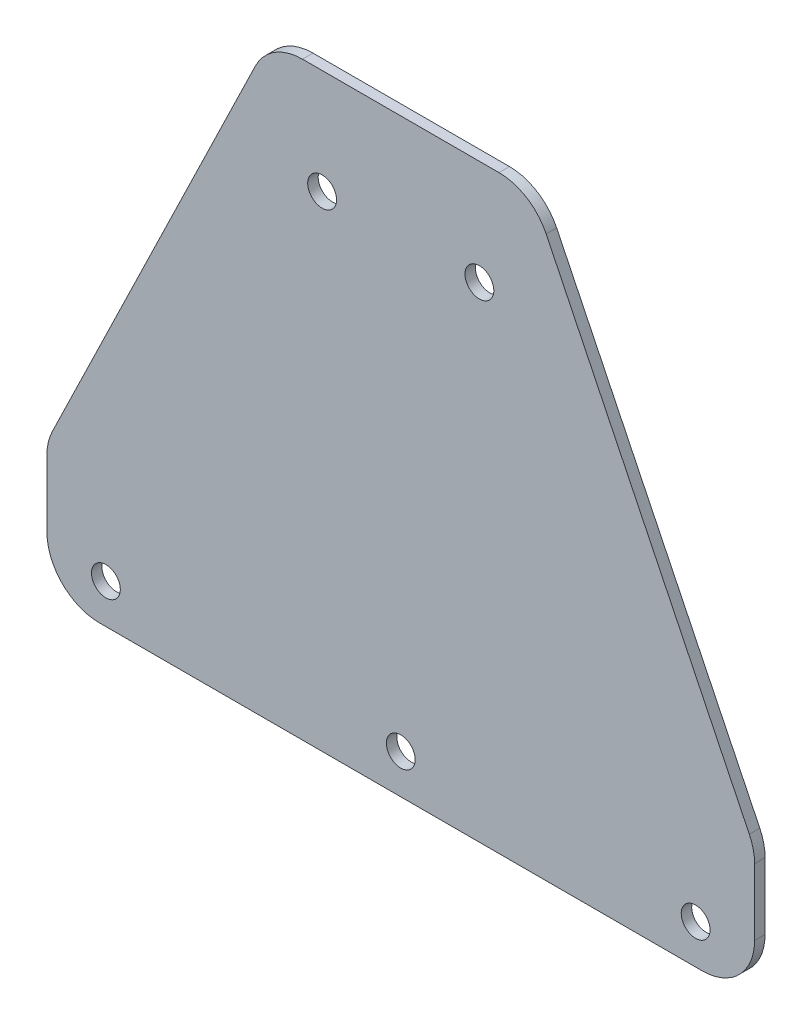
ISO-10303-21;
HEADER;
FILE_DESCRIPTION(('STEP AP214'),'2;1');
FILE_NAME('part.step','',(''),(''),'','','');
FILE_SCHEMA(('AUTOMOTIVE_DESIGN { 1 0 10303 214 1 1 1 1 }'));
ENDSEC;
DATA;
#1=APPLICATION_CONTEXT('core data for automotive mechanical design processes');
#2=APPLICATION_PROTOCOL_DEFINITION('international standard','automotive_design',2000,#1);
#3=PRODUCT_CONTEXT('',#1,'mechanical');
#4=PRODUCT('Part','Part','',(#3));
#5=PRODUCT_RELATED_PRODUCT_CATEGORY('part','',(#4));
#6=PRODUCT_DEFINITION_FORMATION('','',#4);
#7=PRODUCT_DEFINITION_CONTEXT('part definition',#1,'design');
#8=PRODUCT_DEFINITION('design','',#6,#7);
#9=PRODUCT_DEFINITION_SHAPE('','',#8);
#10=(LENGTH_UNIT() NAMED_UNIT(*) SI_UNIT(.MILLI.,.METRE.));
#11=(NAMED_UNIT(*) PLANE_ANGLE_UNIT() SI_UNIT($,.RADIAN.));
#12=(NAMED_UNIT(*) SI_UNIT($,.STERADIAN.) SOLID_ANGLE_UNIT());
#13=UNCERTAINTY_MEASURE_WITH_UNIT(LENGTH_MEASURE(1.E-05),#10,'distance_accuracy_value','');
#14=(GEOMETRIC_REPRESENTATION_CONTEXT(3) GLOBAL_UNCERTAINTY_ASSIGNED_CONTEXT((#13)) GLOBAL_UNIT_ASSIGNED_CONTEXT((#10,
#11,#12)) REPRESENTATION_CONTEXT('',''));
#15=CARTESIAN_POINT('',(0.,0.,0.));
#16=DIRECTION('',(0.,0.,1.));
#17=DIRECTION('',(1.,0.,0.));
#18=AXIS2_PLACEMENT_3D('',#15,#16,#17);
#19=CARTESIAN_POINT('',(135.,50.,4.));
#20=DIRECTION('',(-0.899508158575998,-0.436903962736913,0.));
#21=DIRECTION('',(0.436903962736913,-0.899508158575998,0.));
#22=AXIS2_PLACEMENT_3D('',#19,#20,#21);
#23=PLANE('',#22);
#24=DIRECTION('',(-0.436903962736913,0.899508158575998,0.));
#25=VECTOR('',#24,1.);
#26=CARTESIAN_POINT('',(135.,50.,4.));
#27=LINE('',#26,#25);
#28=CARTESIAN_POINT('',(132.99016317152,54.137899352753,4.));
#29=VERTEX_POINT('',#28);
#30=CARTESIAN_POINT('',(55.4700757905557,213.738079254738,4.));
#31=VERTEX_POINT('',#30);
#32=EDGE_CURVE('E142',#29,#31,#27,.T.);
#33=ORIENTED_EDGE('',*,*,#32,.F.);
#34=DIRECTION('',(0.,0.,-1.));
#35=VECTOR('',#34,1.);
#36=CARTESIAN_POINT('',(132.99016317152,54.137899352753,4.));
#37=LINE('',#36,#35);
#38=CARTESIAN_POINT('',(132.99016317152,54.137899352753,0.));
#39=VERTEX_POINT('',#38);
#40=EDGE_CURVE('E127',#29,#39,#37,.T.);
#41=ORIENTED_EDGE('',*,*,#40,.T.);
#42=DIRECTION('',(-0.436903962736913,0.899508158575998,0.));
#43=VECTOR('',#42,1.);
#44=CARTESIAN_POINT('',(135.,50.,0.));
#45=LINE('',#44,#43);
#46=CARTESIAN_POINT('',(55.4700757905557,213.738079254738,0.));
#47=VERTEX_POINT('',#46);
#48=EDGE_CURVE('E139',#39,#47,#45,.T.);
#49=ORIENTED_EDGE('',*,*,#48,.T.);
#50=DIRECTION('',(0.,0.,-1.));
#51=VECTOR('',#50,1.);
#52=CARTESIAN_POINT('',(55.4700757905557,213.738079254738,4.));
#53=LINE('',#52,#51);
#54=EDGE_CURVE('E144',#47,#31,#53,.F.);
#55=ORIENTED_EDGE('',*,*,#54,.T.);
#56=EDGE_LOOP('',(#33,#41,#49,#55));
#57=FACE_BOUND('',#56,.T.);
#58=ADVANCED_FACE('F33',(#57),#23,.F.);
#59=CARTESIAN_POINT('',(-50.,225.,4.));
#60=DIRECTION('',(0.,-1.,0.));
#61=DIRECTION('',(0.,0.,-1.));
#62=AXIS2_PLACEMENT_3D('',#59,#60,#61);
#63=PLANE('',#62);
#64=DIRECTION('',(-1.,0.,0.));
#65=VECTOR('',#64,1.);
#66=CARTESIAN_POINT('',(-50.,225.,0.));
#67=LINE('',#66,#65);
#68=CARTESIAN_POINT('',(37.4799126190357,225.,0.));
#69=VERTEX_POINT('',#68);
#70=CARTESIAN_POINT('',(-37.4799126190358,225.,0.));
#71=VERTEX_POINT('',#70);
#72=EDGE_CURVE('E148',#69,#71,#67,.T.);
#73=ORIENTED_EDGE('',*,*,#72,.T.);
#74=DIRECTION('',(0.,0.,-1.));
#75=VECTOR('',#74,1.);
#76=CARTESIAN_POINT('',(-37.4799126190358,225.,4.));
#77=LINE('',#76,#75);
#78=CARTESIAN_POINT('',(-37.4799126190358,225.,4.));
#79=VERTEX_POINT('',#78);
#80=EDGE_CURVE('E11',#71,#79,#77,.F.);
#81=ORIENTED_EDGE('',*,*,#80,.T.);
#82=DIRECTION('',(-1.,0.,0.));
#83=VECTOR('',#82,1.);
#84=CARTESIAN_POINT('',(-50.,225.,4.));
#85=LINE('',#84,#83);
#86=CARTESIAN_POINT('',(37.4799126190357,225.,4.));
#87=VERTEX_POINT('',#86);
#88=EDGE_CURVE('E213',#87,#79,#85,.T.);
#89=ORIENTED_EDGE('',*,*,#88,.F.);
#90=DIRECTION('',(0.,0.,-1.));
#91=VECTOR('',#90,1.);
#92=CARTESIAN_POINT('',(37.4799126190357,225.,4.));
#93=LINE('',#92,#91);
#94=EDGE_CURVE('E41',#87,#69,#93,.T.);
#95=ORIENTED_EDGE('',*,*,#94,.T.);
#96=EDGE_LOOP('',(#73,#81,#89,#95));
#97=FACE_BOUND('',#96,.T.);
#98=ADVANCED_FACE('F210',(#97),#63,.F.);
#99=CARTESIAN_POINT('',(-135.,50.,4.));
#100=DIRECTION('',(0.899508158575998,-0.436903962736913,0.));
#101=DIRECTION('',(0.436903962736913,0.899508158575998,0.));
#102=AXIS2_PLACEMENT_3D('',#99,#100,#101);
#103=PLANE('',#102);
#104=DIRECTION('',(-0.436903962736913,-0.899508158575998,0.));
#105=VECTOR('',#104,1.);
#106=CARTESIAN_POINT('',(-135.,50.,0.));
#107=LINE('',#106,#105);
#108=CARTESIAN_POINT('',(-55.4700757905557,213.738079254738,0.));
#109=VERTEX_POINT('',#108);
#110=CARTESIAN_POINT('',(-132.99016317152,54.137899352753,0.));
#111=VERTEX_POINT('',#110);
#112=EDGE_CURVE('E152',#109,#111,#107,.T.);
#113=ORIENTED_EDGE('',*,*,#112,.T.);
#114=DIRECTION('',(0.,0.,-1.));
#115=VECTOR('',#114,1.);
#116=CARTESIAN_POINT('',(-132.99016317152,54.137899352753,4.));
#117=LINE('',#116,#115);
#118=CARTESIAN_POINT('',(-132.99016317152,54.137899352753,4.));
#119=VERTEX_POINT('',#118);
#120=EDGE_CURVE('E205',#111,#119,#117,.F.);
#121=ORIENTED_EDGE('',*,*,#120,.T.);
#122=DIRECTION('',(-0.436903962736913,-0.899508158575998,0.));
#123=VECTOR('',#122,1.);
#124=CARTESIAN_POINT('',(-135.,50.,4.));
#125=LINE('',#124,#123);
#126=CARTESIAN_POINT('',(-55.4700757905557,213.738079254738,4.));
#127=VERTEX_POINT('',#126);
#128=EDGE_CURVE('E226',#127,#119,#125,.T.);
#129=ORIENTED_EDGE('',*,*,#128,.F.);
#130=DIRECTION('',(0.,0.,-1.));
#131=VECTOR('',#130,1.);
#132=CARTESIAN_POINT('',(-55.4700757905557,213.738079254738,4.));
#133=LINE('',#132,#131);
#134=EDGE_CURVE('E202',#127,#109,#133,.T.);
#135=ORIENTED_EDGE('',*,*,#134,.T.);
#136=EDGE_LOOP('',(#113,#121,#129,#135));
#137=FACE_BOUND('',#136,.T.);
#138=ADVANCED_FACE('F223',(#137),#103,.F.);
#139=CARTESIAN_POINT('',(-135.,0.,4.));
#140=DIRECTION('',(1.,0.,0.));
#141=DIRECTION('',(0.,0.,-1.));
#142=AXIS2_PLACEMENT_3D('',#139,#140,#141);
#143=PLANE('',#142);
#144=DIRECTION('',(0.,-1.,0.));
#145=VECTOR('',#144,1.);
#146=CARTESIAN_POINT('',(-135.,0.,0.));
#147=LINE('',#146,#145);
#148=CARTESIAN_POINT('',(-135.,45.3998200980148,0.));
#149=VERTEX_POINT('',#148);
#150=CARTESIAN_POINT('',(-135.,20.,0.));
#151=VERTEX_POINT('',#150);
#152=EDGE_CURVE('E163',#149,#151,#147,.T.);
#153=ORIENTED_EDGE('',*,*,#152,.T.);
#154=DIRECTION('',(0.,0.,-1.));
#155=VECTOR('',#154,1.);
#156=CARTESIAN_POINT('',(-135.,20.,4.));
#157=LINE('',#156,#155);
#158=CARTESIAN_POINT('',(-135.,20.,4.));
#159=VERTEX_POINT('',#158);
#160=EDGE_CURVE('E200',#151,#159,#157,.F.);
#161=ORIENTED_EDGE('',*,*,#160,.T.);
#162=DIRECTION('',(0.,-1.,0.));
#163=VECTOR('',#162,1.);
#164=CARTESIAN_POINT('',(-135.,0.,4.));
#165=LINE('',#164,#163);
#166=CARTESIAN_POINT('',(-135.,45.3998200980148,4.));
#167=VERTEX_POINT('',#166);
#168=EDGE_CURVE('E228',#167,#159,#165,.T.);
#169=ORIENTED_EDGE('',*,*,#168,.F.);
#170=DIRECTION('',(0.,0.,-1.));
#171=VECTOR('',#170,1.);
#172=CARTESIAN_POINT('',(-135.,45.3998200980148,4.));
#173=LINE('',#172,#171);
#174=EDGE_CURVE('E197',#167,#149,#173,.T.);
#175=ORIENTED_EDGE('',*,*,#174,.T.);
#176=EDGE_LOOP('',(#153,#161,#169,#175));
#177=FACE_BOUND('',#176,.T.);
#178=ADVANCED_FACE('F251',(#177),#143,.F.);
#179=CARTESIAN_POINT('',(135.,0.,4.));
#180=DIRECTION('',(0.,1.,0.));
#181=DIRECTION('',(-1.,0.,0.));
#182=AXIS2_PLACEMENT_3D('',#179,#180,#181);
#183=PLANE('',#182);
#184=DIRECTION('',(1.,0.,0.));
#185=VECTOR('',#184,1.);
#186=CARTESIAN_POINT('',(135.,0.,0.));
#187=LINE('',#186,#185);
#188=CARTESIAN_POINT('',(-115.,0.,0.));
#189=VERTEX_POINT('',#188);
#190=CARTESIAN_POINT('',(115.,0.,0.));
#191=VERTEX_POINT('',#190);
#192=EDGE_CURVE('E166',#189,#191,#187,.T.);
#193=ORIENTED_EDGE('',*,*,#192,.T.);
#194=DIRECTION('',(0.,0.,-1.));
#195=VECTOR('',#194,1.);
#196=CARTESIAN_POINT('',(115.,0.,4.));
#197=LINE('',#196,#195);
#198=CARTESIAN_POINT('',(115.,0.,4.));
#199=VERTEX_POINT('',#198);
#200=EDGE_CURVE('E48',#191,#199,#197,.F.);
#201=ORIENTED_EDGE('',*,*,#200,.T.);
#202=DIRECTION('',(1.,0.,0.));
#203=VECTOR('',#202,1.);
#204=CARTESIAN_POINT('',(135.,0.,4.));
#205=LINE('',#204,#203);
#206=CARTESIAN_POINT('',(-115.,0.,4.));
#207=VERTEX_POINT('',#206);
#208=EDGE_CURVE('E230',#207,#199,#205,.T.);
#209=ORIENTED_EDGE('',*,*,#208,.F.);
#210=DIRECTION('',(0.,0.,-1.));
#211=VECTOR('',#210,1.);
#212=CARTESIAN_POINT('',(-115.,0.,4.));
#213=LINE('',#212,#211);
#214=EDGE_CURVE('E193',#207,#189,#213,.T.);
#215=ORIENTED_EDGE('',*,*,#214,.T.);
#216=EDGE_LOOP('',(#193,#201,#209,#215));
#217=FACE_BOUND('',#216,.T.);
#218=ADVANCED_FACE('F244',(#217),#183,.F.);
#219=CARTESIAN_POINT('',(135.,0.,4.));
#220=DIRECTION('',(-1.,0.,0.));
#221=DIRECTION('',(0.,0.,1.));
#222=AXIS2_PLACEMENT_3D('',#219,#220,#221);
#223=PLANE('',#222);
#224=DIRECTION('',(0.,1.,0.));
#225=VECTOR('',#224,1.);
#226=CARTESIAN_POINT('',(135.,0.,0.));
#227=LINE('',#226,#225);
#228=CARTESIAN_POINT('',(135.,20.,0.));
#229=VERTEX_POINT('',#228);
#230=CARTESIAN_POINT('',(135.,45.3998200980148,0.));
#231=VERTEX_POINT('',#230);
#232=EDGE_CURVE('E168',#229,#231,#227,.T.);
#233=ORIENTED_EDGE('',*,*,#232,.T.);
#234=DIRECTION('',(0.,0.,-1.));
#235=VECTOR('',#234,1.);
#236=CARTESIAN_POINT('',(135.,45.3998200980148,4.));
#237=LINE('',#236,#235);
#238=CARTESIAN_POINT('',(135.,45.3998200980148,4.));
#239=VERTEX_POINT('',#238);
#240=EDGE_CURVE('E128',#231,#239,#237,.F.);
#241=ORIENTED_EDGE('',*,*,#240,.T.);
#242=DIRECTION('',(0.,1.,0.));
#243=VECTOR('',#242,1.);
#244=CARTESIAN_POINT('',(135.,0.,4.));
#245=LINE('',#244,#243);
#246=CARTESIAN_POINT('',(135.,20.,4.));
#247=VERTEX_POINT('',#246);
#248=EDGE_CURVE('E158',#247,#239,#245,.T.);
#249=ORIENTED_EDGE('',*,*,#248,.F.);
#250=DIRECTION('',(0.,0.,-1.));
#251=VECTOR('',#250,1.);
#252=CARTESIAN_POINT('',(135.,20.,4.));
#253=LINE('',#252,#251);
#254=EDGE_CURVE('E133',#247,#229,#253,.T.);
#255=ORIENTED_EDGE('',*,*,#254,.T.);
#256=EDGE_LOOP('',(#233,#241,#249,#255));
#257=FACE_BOUND('',#256,.T.);
#258=ADVANCED_FACE('F240',(#257),#223,.F.);
#259=CARTESIAN_POINT('',(50.,225.,4.));
#260=DIRECTION('',(0.,0.,-1.));
#261=DIRECTION('',(-1.,0.,0.));
#262=AXIS2_PLACEMENT_3D('',#259,#260,#261);
#263=PLANE('',#262);
#264=CARTESIAN_POINT('',(30.,185.,4.));
#265=DIRECTION('',(0.,0.,1.));
#266=DIRECTION('',(-1.,0.,0.));
#267=AXIS2_PLACEMENT_3D('',#264,#265,#266);
#268=CIRCLE('',#267,5.5);
#269=CARTESIAN_POINT('',(24.5,185.,4.));
#270=VERTEX_POINT('',#269);
#271=EDGE_CURVE('E424',#270,#270,#268,.T.);
#272=ORIENTED_EDGE('',*,*,#271,.F.);
#273=EDGE_LOOP('',(#272));
#274=FACE_BOUND('',#273,.T.);
#275=CARTESIAN_POINT('',(112.5,15.,4.));
#276=DIRECTION('',(0.,0.,1.));
#277=DIRECTION('',(-1.,0.,0.));
#278=AXIS2_PLACEMENT_3D('',#275,#276,#277);
#279=CIRCLE('',#278,5.5);
#280=CARTESIAN_POINT('',(107.,15.,4.));
#281=VERTEX_POINT('',#280);
#282=EDGE_CURVE('E426',#281,#281,#279,.T.);
#283=ORIENTED_EDGE('',*,*,#282,.F.);
#284=EDGE_LOOP('',(#283));
#285=FACE_BOUND('',#284,.T.);
#286=CARTESIAN_POINT('',(-30.,185.,4.));
#287=DIRECTION('',(0.,0.,1.));
#288=DIRECTION('',(1.,0.,0.));
#289=AXIS2_PLACEMENT_3D('',#286,#287,#288);
#290=CIRCLE('',#289,5.5);
#291=CARTESIAN_POINT('',(-24.5,185.,4.));
#292=VERTEX_POINT('',#291);
#293=EDGE_CURVE('E432',#292,#292,#290,.T.);
#294=ORIENTED_EDGE('',*,*,#293,.F.);
#295=EDGE_LOOP('',(#294));
#296=FACE_BOUND('',#295,.T.);
#297=CARTESIAN_POINT('',(-112.5,15.,4.));
#298=DIRECTION('',(0.,0.,1.));
#299=DIRECTION('',(1.,0.,0.));
#300=AXIS2_PLACEMENT_3D('',#297,#298,#299);
#301=CIRCLE('',#300,5.5);
#302=CARTESIAN_POINT('',(-107.,15.,4.));
#303=VERTEX_POINT('',#302);
#304=EDGE_CURVE('E438',#303,#303,#301,.T.);
#305=ORIENTED_EDGE('',*,*,#304,.F.);
#306=EDGE_LOOP('',(#305));
#307=FACE_BOUND('',#306,.T.);
#308=CARTESIAN_POINT('',(0.,15.,4.));
#309=DIRECTION('',(0.,0.,1.));
#310=DIRECTION('',(1.,0.,0.));
#311=AXIS2_PLACEMENT_3D('',#308,#309,#310);
#312=CIRCLE('',#311,5.5);
#313=CARTESIAN_POINT('',(5.5,15.,4.));
#314=VERTEX_POINT('',#313);
#315=EDGE_CURVE('E155',#314,#314,#312,.T.);
#316=ORIENTED_EDGE('',*,*,#315,.F.);
#317=EDGE_LOOP('',(#316));
#318=FACE_BOUND('',#317,.T.);
#319=ORIENTED_EDGE('',*,*,#248,.T.);
#320=CARTESIAN_POINT('',(115.,45.3998200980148,4.));
#321=DIRECTION('',(0.,0.,-1.));
#322=DIRECTION('',(-1.,0.,0.));
#323=AXIS2_PLACEMENT_3D('',#320,#321,#322);
#324=CIRCLE('',#323,20.);
#325=EDGE_CURVE('E191',#239,#29,#324,.F.);
#326=ORIENTED_EDGE('',*,*,#325,.T.);
#327=ORIENTED_EDGE('',*,*,#32,.T.);
#328=CARTESIAN_POINT('',(37.4799126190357,205.,4.));
#329=DIRECTION('',(0.,0.,-1.));
#330=DIRECTION('',(-1.,0.,0.));
#331=AXIS2_PLACEMENT_3D('',#328,#329,#330);
#332=CIRCLE('',#331,20.);
#333=EDGE_CURVE('E182',#31,#87,#332,.F.);
#334=ORIENTED_EDGE('',*,*,#333,.T.);
#335=ORIENTED_EDGE('',*,*,#88,.T.);
#336=CARTESIAN_POINT('',(-37.4799126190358,205.,4.));
#337=DIRECTION('',(0.,0.,-1.));
#338=DIRECTION('',(-1.,0.,0.));
#339=AXIS2_PLACEMENT_3D('',#336,#337,#338);
#340=CIRCLE('',#339,20.);
#341=EDGE_CURVE('E184',#79,#127,#340,.F.);
#342=ORIENTED_EDGE('',*,*,#341,.T.);
#343=ORIENTED_EDGE('',*,*,#128,.T.);
#344=CARTESIAN_POINT('',(-115.,45.3998200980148,4.));
#345=DIRECTION('',(0.,0.,-1.));
#346=DIRECTION('',(-1.,0.,0.));
#347=AXIS2_PLACEMENT_3D('',#344,#345,#346);
#348=CIRCLE('',#347,20.);
#349=EDGE_CURVE('E186',#119,#167,#348,.F.);
#350=ORIENTED_EDGE('',*,*,#349,.T.);
#351=ORIENTED_EDGE('',*,*,#168,.T.);
#352=CARTESIAN_POINT('',(-115.,20.,4.));
#353=DIRECTION('',(0.,0.,-1.));
#354=DIRECTION('',(-1.,0.,0.));
#355=AXIS2_PLACEMENT_3D('',#352,#353,#354);
#356=CIRCLE('',#355,20.);
#357=EDGE_CURVE('E55',#159,#207,#356,.F.);
#358=ORIENTED_EDGE('',*,*,#357,.T.);
#359=ORIENTED_EDGE('',*,*,#208,.T.);
#360=CARTESIAN_POINT('',(115.,20.,4.));
#361=DIRECTION('',(0.,0.,-1.));
#362=DIRECTION('',(-1.,0.,0.));
#363=AXIS2_PLACEMENT_3D('',#360,#361,#362);
#364=CIRCLE('',#363,20.);
#365=EDGE_CURVE('E189',#199,#247,#364,.F.);
#366=ORIENTED_EDGE('',*,*,#365,.T.);
#367=EDGE_LOOP('',(#319,#326,#327,#334,#335,#342,#343,#350,#351,#358,#359,#366));
#368=FACE_BOUND('',#367,.T.);
#369=ADVANCED_FACE('F237',(#274,#285,#296,#307,#318,#368),#263,.F.);
#370=CARTESIAN_POINT('',(50.,225.,0.));
#371=DIRECTION('',(0.,0.,-1.));
#372=DIRECTION('',(-1.,0.,0.));
#373=AXIS2_PLACEMENT_3D('',#370,#371,#372);
#374=PLANE('',#373);
#375=CARTESIAN_POINT('',(30.,185.,0.));
#376=DIRECTION('',(0.,0.,1.));
#377=DIRECTION('',(-1.,0.,0.));
#378=AXIS2_PLACEMENT_3D('',#375,#376,#377);
#379=CIRCLE('',#378,5.5);
#380=CARTESIAN_POINT('',(24.5,185.,0.));
#381=VERTEX_POINT('',#380);
#382=EDGE_CURVE('E421',#381,#381,#379,.T.);
#383=ORIENTED_EDGE('',*,*,#382,.T.);
#384=EDGE_LOOP('',(#383));
#385=FACE_BOUND('',#384,.T.);
#386=CARTESIAN_POINT('',(112.5,15.,0.));
#387=DIRECTION('',(0.,0.,1.));
#388=DIRECTION('',(-1.,0.,0.));
#389=AXIS2_PLACEMENT_3D('',#386,#387,#388);
#390=CIRCLE('',#389,5.5);
#391=CARTESIAN_POINT('',(107.,15.,0.));
#392=VERTEX_POINT('',#391);
#393=EDGE_CURVE('E429',#392,#392,#390,.T.);
#394=ORIENTED_EDGE('',*,*,#393,.T.);
#395=EDGE_LOOP('',(#394));
#396=FACE_BOUND('',#395,.T.);
#397=CARTESIAN_POINT('',(-30.,185.,0.));
#398=DIRECTION('',(0.,0.,1.));
#399=DIRECTION('',(1.,0.,0.));
#400=AXIS2_PLACEMENT_3D('',#397,#398,#399);
#401=CIRCLE('',#400,5.5);
#402=CARTESIAN_POINT('',(-24.5,185.,0.));
#403=VERTEX_POINT('',#402);
#404=EDGE_CURVE('E435',#403,#403,#401,.T.);
#405=ORIENTED_EDGE('',*,*,#404,.T.);
#406=EDGE_LOOP('',(#405));
#407=FACE_BOUND('',#406,.T.);
#408=CARTESIAN_POINT('',(-112.5,15.,0.));
#409=DIRECTION('',(0.,0.,1.));
#410=DIRECTION('',(1.,0.,0.));
#411=AXIS2_PLACEMENT_3D('',#408,#409,#410);
#412=CIRCLE('',#411,5.5);
#413=CARTESIAN_POINT('',(-107.,15.,0.));
#414=VERTEX_POINT('',#413);
#415=EDGE_CURVE('E441',#414,#414,#412,.T.);
#416=ORIENTED_EDGE('',*,*,#415,.T.);
#417=EDGE_LOOP('',(#416));
#418=FACE_BOUND('',#417,.T.);
#419=CARTESIAN_POINT('',(0.,15.,0.));
#420=DIRECTION('',(0.,0.,1.));
#421=DIRECTION('',(1.,0.,0.));
#422=AXIS2_PLACEMENT_3D('',#419,#420,#421);
#423=CIRCLE('',#422,5.5);
#424=CARTESIAN_POINT('',(5.5,15.,0.));
#425=VERTEX_POINT('',#424);
#426=EDGE_CURVE('E149',#425,#425,#423,.T.);
#427=ORIENTED_EDGE('',*,*,#426,.T.);
#428=EDGE_LOOP('',(#427));
#429=FACE_BOUND('',#428,.T.);
#430=ORIENTED_EDGE('',*,*,#48,.F.);
#431=CARTESIAN_POINT('',(115.,45.3998200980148,0.));
#432=DIRECTION('',(0.,0.,-1.));
#433=DIRECTION('',(-1.,0.,0.));
#434=AXIS2_PLACEMENT_3D('',#431,#432,#433);
#435=CIRCLE('',#434,20.);
#436=EDGE_CURVE('E123',#39,#231,#435,.T.);
#437=ORIENTED_EDGE('',*,*,#436,.T.);
#438=ORIENTED_EDGE('',*,*,#232,.F.);
#439=CARTESIAN_POINT('',(115.,20.,0.));
#440=DIRECTION('',(0.,0.,-1.));
#441=DIRECTION('',(-1.,0.,0.));
#442=AXIS2_PLACEMENT_3D('',#439,#440,#441);
#443=CIRCLE('',#442,20.);
#444=EDGE_CURVE('E134',#229,#191,#443,.T.);
#445=ORIENTED_EDGE('',*,*,#444,.T.);
#446=ORIENTED_EDGE('',*,*,#192,.F.);
#447=CARTESIAN_POINT('',(-115.,20.,0.));
#448=DIRECTION('',(0.,0.,-1.));
#449=DIRECTION('',(-1.,0.,0.));
#450=AXIS2_PLACEMENT_3D('',#447,#448,#449);
#451=CIRCLE('',#450,20.);
#452=EDGE_CURVE('E176',#189,#151,#451,.T.);
#453=ORIENTED_EDGE('',*,*,#452,.T.);
#454=ORIENTED_EDGE('',*,*,#152,.F.);
#455=CARTESIAN_POINT('',(-115.,45.3998200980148,0.));
#456=DIRECTION('',(0.,0.,-1.));
#457=DIRECTION('',(-1.,0.,0.));
#458=AXIS2_PLACEMENT_3D('',#455,#456,#457);
#459=CIRCLE('',#458,20.);
#460=EDGE_CURVE('E174',#149,#111,#459,.T.);
#461=ORIENTED_EDGE('',*,*,#460,.T.);
#462=ORIENTED_EDGE('',*,*,#112,.F.);
#463=CARTESIAN_POINT('',(-37.4799126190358,205.,0.));
#464=DIRECTION('',(0.,0.,-1.));
#465=DIRECTION('',(-1.,0.,0.));
#466=AXIS2_PLACEMENT_3D('',#463,#464,#465);
#467=CIRCLE('',#466,20.);
#468=EDGE_CURVE('E172',#109,#71,#467,.T.);
#469=ORIENTED_EDGE('',*,*,#468,.T.);
#470=ORIENTED_EDGE('',*,*,#72,.F.);
#471=CARTESIAN_POINT('',(37.4799126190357,205.,0.));
#472=DIRECTION('',(0.,0.,-1.));
#473=DIRECTION('',(-1.,0.,0.));
#474=AXIS2_PLACEMENT_3D('',#471,#472,#473);
#475=CIRCLE('',#474,20.);
#476=EDGE_CURVE('E143',#69,#47,#475,.T.);
#477=ORIENTED_EDGE('',*,*,#476,.T.);
#478=EDGE_LOOP('',(#430,#437,#438,#445,#446,#453,#454,#461,#462,#469,#470,#477));
#479=FACE_BOUND('',#478,.T.);
#480=ADVANCED_FACE('F146',(#385,#396,#407,#418,#429,#479),#374,.T.);
#481=CARTESIAN_POINT('',(115.,45.3998200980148,4.));
#482=DIRECTION('',(0.,0.,-1.));
#483=DIRECTION('',(-1.,0.,0.));
#484=AXIS2_PLACEMENT_3D('',#481,#482,#483);
#485=CYLINDRICAL_SURFACE('',#484,20.);
#486=ORIENTED_EDGE('',*,*,#325,.F.);
#487=ORIENTED_EDGE('',*,*,#240,.F.);
#488=ORIENTED_EDGE('',*,*,#436,.F.);
#489=ORIENTED_EDGE('',*,*,#40,.F.);
#490=EDGE_LOOP('',(#486,#487,#488,#489));
#491=FACE_BOUND('',#490,.T.);
#492=ADVANCED_FACE('F126',(#491),#485,.T.);
#493=CARTESIAN_POINT('',(115.,20.,4.));
#494=DIRECTION('',(0.,0.,-1.));
#495=DIRECTION('',(-1.,0.,0.));
#496=AXIS2_PLACEMENT_3D('',#493,#494,#495);
#497=CYLINDRICAL_SURFACE('',#496,20.);
#498=ORIENTED_EDGE('',*,*,#365,.F.);
#499=ORIENTED_EDGE('',*,*,#200,.F.);
#500=ORIENTED_EDGE('',*,*,#444,.F.);
#501=ORIENTED_EDGE('',*,*,#254,.F.);
#502=EDGE_LOOP('',(#498,#499,#500,#501));
#503=FACE_BOUND('',#502,.T.);
#504=ADVANCED_FACE('F242',(#503),#497,.T.);
#505=CARTESIAN_POINT('',(-115.,20.,4.));
#506=DIRECTION('',(0.,0.,-1.));
#507=DIRECTION('',(-1.,0.,0.));
#508=AXIS2_PLACEMENT_3D('',#505,#506,#507);
#509=CYLINDRICAL_SURFACE('',#508,20.);
#510=ORIENTED_EDGE('',*,*,#357,.F.);
#511=ORIENTED_EDGE('',*,*,#160,.F.);
#512=ORIENTED_EDGE('',*,*,#452,.F.);
#513=ORIENTED_EDGE('',*,*,#214,.F.);
#514=EDGE_LOOP('',(#510,#511,#512,#513));
#515=FACE_BOUND('',#514,.T.);
#516=ADVANCED_FACE('F247',(#515),#509,.T.);
#517=CARTESIAN_POINT('',(-115.,45.3998200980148,4.));
#518=DIRECTION('',(0.,0.,-1.));
#519=DIRECTION('',(-1.,0.,0.));
#520=AXIS2_PLACEMENT_3D('',#517,#518,#519);
#521=CYLINDRICAL_SURFACE('',#520,20.);
#522=ORIENTED_EDGE('',*,*,#349,.F.);
#523=ORIENTED_EDGE('',*,*,#120,.F.);
#524=ORIENTED_EDGE('',*,*,#460,.F.);
#525=ORIENTED_EDGE('',*,*,#174,.F.);
#526=EDGE_LOOP('',(#522,#523,#524,#525));
#527=FACE_BOUND('',#526,.T.);
#528=ADVANCED_FACE('F255',(#527),#521,.T.);
#529=CARTESIAN_POINT('',(-37.4799126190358,205.,4.));
#530=DIRECTION('',(0.,0.,-1.));
#531=DIRECTION('',(-1.,0.,0.));
#532=AXIS2_PLACEMENT_3D('',#529,#530,#531);
#533=CYLINDRICAL_SURFACE('',#532,20.);
#534=ORIENTED_EDGE('',*,*,#341,.F.);
#535=ORIENTED_EDGE('',*,*,#80,.F.);
#536=ORIENTED_EDGE('',*,*,#468,.F.);
#537=ORIENTED_EDGE('',*,*,#134,.F.);
#538=EDGE_LOOP('',(#534,#535,#536,#537));
#539=FACE_BOUND('',#538,.T.);
#540=ADVANCED_FACE('F220',(#539),#533,.T.);
#541=CARTESIAN_POINT('',(37.4799126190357,205.,4.));
#542=DIRECTION('',(0.,0.,-1.));
#543=DIRECTION('',(-1.,0.,0.));
#544=AXIS2_PLACEMENT_3D('',#541,#542,#543);
#545=CYLINDRICAL_SURFACE('',#544,20.);
#546=ORIENTED_EDGE('',*,*,#333,.F.);
#547=ORIENTED_EDGE('',*,*,#54,.F.);
#548=ORIENTED_EDGE('',*,*,#476,.F.);
#549=ORIENTED_EDGE('',*,*,#94,.F.);
#550=EDGE_LOOP('',(#546,#547,#548,#549));
#551=FACE_BOUND('',#550,.T.);
#552=ADVANCED_FACE('F35',(#551),#545,.T.);
#553=CARTESIAN_POINT('',(0.,15.,0.));
#554=DIRECTION('',(0.,0.,1.));
#555=DIRECTION('',(1.,0.,0.));
#556=AXIS2_PLACEMENT_3D('',#553,#554,#555);
#557=CYLINDRICAL_SURFACE('',#556,5.5);
#558=ORIENTED_EDGE('',*,*,#426,.F.);
#559=EDGE_LOOP('',(#558));
#560=FACE_BOUND('',#559,.T.);
#561=ORIENTED_EDGE('',*,*,#315,.T.);
#562=EDGE_LOOP('',(#561));
#563=FACE_BOUND('',#562,.T.);
#564=ADVANCED_FACE('F302',(#560,#563),#557,.F.);
#565=CARTESIAN_POINT('',(-112.5,15.,0.));
#566=DIRECTION('',(0.,0.,1.));
#567=DIRECTION('',(1.,0.,0.));
#568=AXIS2_PLACEMENT_3D('',#565,#566,#567);
#569=CYLINDRICAL_SURFACE('',#568,5.5);
#570=ORIENTED_EDGE('',*,*,#415,.F.);
#571=EDGE_LOOP('',(#570));
#572=FACE_BOUND('',#571,.T.);
#573=ORIENTED_EDGE('',*,*,#304,.T.);
#574=EDGE_LOOP('',(#573));
#575=FACE_BOUND('',#574,.T.);
#576=ADVANCED_FACE('F330',(#572,#575),#569,.F.);
#577=CARTESIAN_POINT('',(-30.,185.,0.));
#578=DIRECTION('',(0.,0.,1.));
#579=DIRECTION('',(1.,0.,0.));
#580=AXIS2_PLACEMENT_3D('',#577,#578,#579);
#581=CYLINDRICAL_SURFACE('',#580,5.5);
#582=ORIENTED_EDGE('',*,*,#404,.F.);
#583=EDGE_LOOP('',(#582));
#584=FACE_BOUND('',#583,.T.);
#585=ORIENTED_EDGE('',*,*,#293,.T.);
#586=EDGE_LOOP('',(#585));
#587=FACE_BOUND('',#586,.T.);
#588=ADVANCED_FACE('F340',(#584,#587),#581,.F.);
#589=CARTESIAN_POINT('',(112.5,15.,0.));
#590=DIRECTION('',(0.,0.,1.));
#591=DIRECTION('',(1.,0.,0.));
#592=AXIS2_PLACEMENT_3D('',#589,#590,#591);
#593=CYLINDRICAL_SURFACE('',#592,5.5);
#594=ORIENTED_EDGE('',*,*,#393,.F.);
#595=EDGE_LOOP('',(#594));
#596=FACE_BOUND('',#595,.T.);
#597=ORIENTED_EDGE('',*,*,#282,.T.);
#598=EDGE_LOOP('',(#597));
#599=FACE_BOUND('',#598,.T.);
#600=ADVANCED_FACE('F350',(#596,#599),#593,.F.);
#601=CARTESIAN_POINT('',(30.,185.,0.));
#602=DIRECTION('',(0.,0.,1.));
#603=DIRECTION('',(1.,0.,0.));
#604=AXIS2_PLACEMENT_3D('',#601,#602,#603);
#605=CYLINDRICAL_SURFACE('',#604,5.5);
#606=ORIENTED_EDGE('',*,*,#382,.F.);
#607=EDGE_LOOP('',(#606));
#608=FACE_BOUND('',#607,.T.);
#609=ORIENTED_EDGE('',*,*,#271,.T.);
#610=EDGE_LOOP('',(#609));
#611=FACE_BOUND('',#610,.T.);
#612=ADVANCED_FACE('F360',(#608,#611),#605,.F.);
#613=CLOSED_SHELL('',(#58,#98,#138,#178,#218,#258,#369,#480,#492,#504,#516,#528,#540,#552,#564,
#576,#588,#600,#612));
#614=MANIFOLD_SOLID_BREP('B2',#613);
#615=ADVANCED_BREP_SHAPE_REPRESENTATION('',(#18,#614),#14);
#616=SHAPE_DEFINITION_REPRESENTATION(#9,#615);
ENDSEC;
END-ISO-10303-21;
